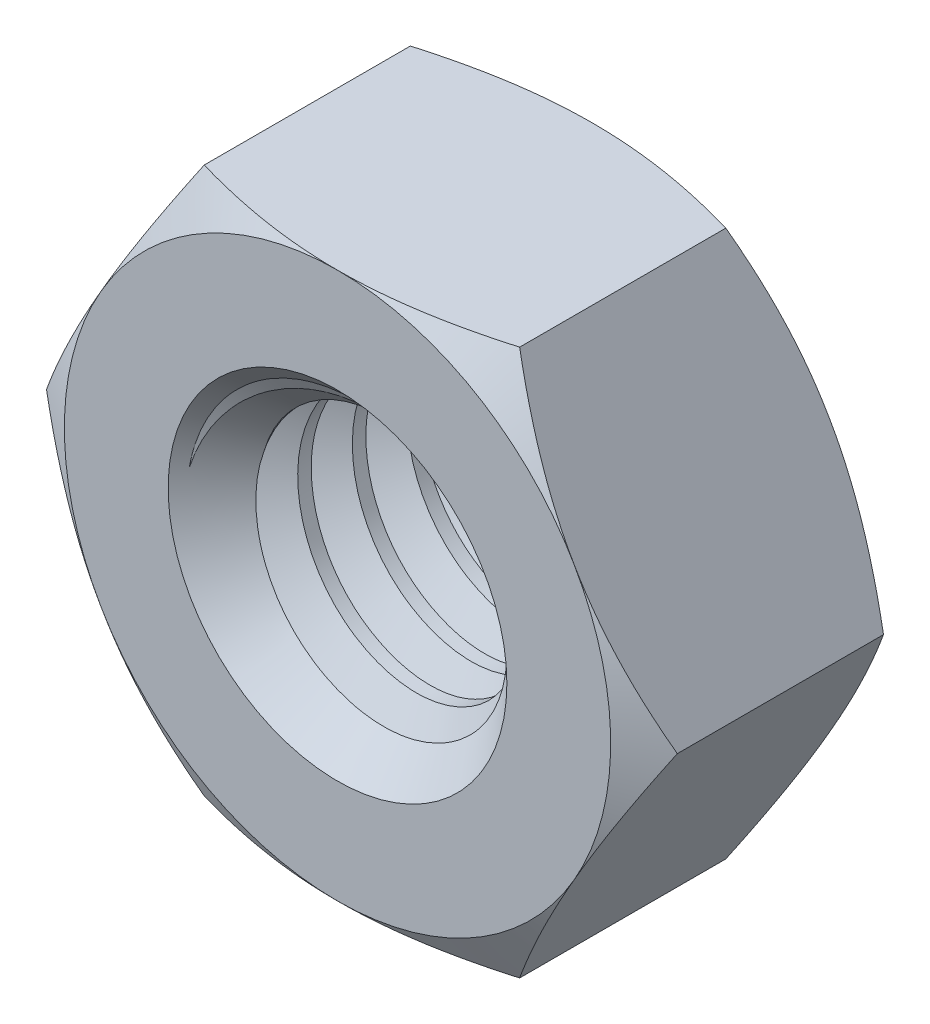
from build123d import *

# Parameters (mm, degrees)
Y_KSEKLIK_EKSTR_ZYON1_DEPTH = 2.8
IZIM2_OUTSIDE_W             = 20.544
IZIM2_OUTSIDE_H             = 19.616
IZIM2_OUTSIDE_R             = 3
KES_EKSTR_ZYON1_DEPTH       = 2.8
KES_EKSTR_ZYON1_DRAFT       = -60
IZIM3_OUTSIDE_W             = 20.544
IZIM3_OUTSIDE_H             = 19.616
IZIM3_OUTSIDE_R             = 3
KES_EKSTR_ZYON2_DEPTH       = 2.8
KES_EKSTR_ZYON2_DRAFT       = -60
IZIM4_R                     = 1.36
KES_EKSTR_ZYON3_DEPTH       = 2.8
PAH1_SIZE                   = 0.5
KES_S_P_R1_PITCH            = 0.6
KES_S_P_R1_HEIGHT           = 4
KES_S_P_R1_RADIUS           = 1.36


with BuildPart() as part:
    # izim1 → Y_kseklik-Ekstr_zyon1 (new body)
    with BuildSketch(Plane.XY):
        Polygon((3.464101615, 0), (1.732050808, 3), (-1.732050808, 3), (-3.464101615, 0), (-1.732050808, -3), (1.732050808, -3), align=None)
    extrude(amount=Y_KSEKLIK_EKSTR_ZYON1_DEPTH)


with BuildPart() as kes_ekstr_zyon1_tool:
    # izim2 outside → Kes-Ekstr_zyon1 (with draft: the straight prism first)
    with BuildSketch(Plane.XY.offset(2.8)):
        Rectangle(IZIM2_OUTSIDE_W, IZIM2_OUTSIDE_H)
        Circle(IZIM2_OUTSIDE_R, mode=Mode.SUBTRACT)
    extrude(amount=-KES_EKSTR_ZYON1_DEPTH)
    # Kes-Ekstr_zyon1: the draft: its side faces are tilted about the plane it starts from
    kes_ekstr_zyon1_sides = [kes_ekstr_zyon1_tool.faces().sort_by_distance(p)[0] for p in [
        (0, -9.808, 1.4),
        (10.272, 0, 1.4),
        (0, 9.808, 1.4),
        (-10.272, 0, 1.4),
        (-3, 0, 1.4),
    ]]
    draft(kes_ekstr_zyon1_sides, Plane.XY.offset(2.8), KES_EKSTR_ZYON1_DRAFT)


with BuildPart() as part_1:
    add(part.part)

    # Kes-Ekstr_zyon1: cut by kes_ekstr_zyon1_tool
    add(kes_ekstr_zyon1_tool.part, mode=Mode.SUBTRACT)


with BuildPart() as kes_ekstr_zyon2_tool:
    # izim3 outside → Kes-Ekstr_zyon2 (with draft: the straight prism first)
    with BuildSketch(Plane(origin=(0, 0, 0), x_dir=(-1, 0, 0), z_dir=(0, 0, -1))):
        Rectangle(IZIM3_OUTSIDE_W, IZIM3_OUTSIDE_H)
        Circle(IZIM3_OUTSIDE_R, mode=Mode.SUBTRACT)
    extrude(amount=-KES_EKSTR_ZYON2_DEPTH)
    # Kes-Ekstr_zyon2: the draft: its side faces are tilted about the plane it starts from
    kes_ekstr_zyon2_sides = [kes_ekstr_zyon2_tool.faces().sort_by_distance(p)[0] for p in [
        (0, -9.808, 1.4),
        (-10.272, 0, 1.4),
        (0, 9.808, 1.4),
        (10.272, 0, 1.4),
        (3, 0, 1.4),
    ]]
    draft(kes_ekstr_zyon2_sides, Plane(origin=(0, 0, 0), x_dir=(-1, 0, 0), z_dir=(0, 0, -1)), KES_EKSTR_ZYON2_DRAFT)


with BuildPart() as part_2:
    add(part_1.part)

    # Kes-Ekstr_zyon2: cut by kes_ekstr_zyon2_tool
    add(kes_ekstr_zyon2_tool.part, mode=Mode.SUBTRACT)

    # izim4 → Kes-Ekstr_zyon3 (cut)
    with BuildSketch(Plane(origin=(0, 0, 0), x_dir=(-1, 0, 0), z_dir=(0, 0, -1))):
        Circle(IZIM4_R)
    extrude(amount=-KES_EKSTR_ZYON3_DEPTH, mode=Mode.SUBTRACT)

    # Pah1
    pah1_edges = [part_2.edges().sort_by_distance(p)[0] for p in [
        (1.36, 0, 2.8),
        (1.36, 0, 0),
    ]]
    chamfer(pah1_edges, length=PAH1_SIZE)

    # Kes-S_p_r1: sweep along a helix
    with BuildLine() as kes_s_p_r1_path:
        Helix(KES_S_P_R1_PITCH, KES_S_P_R1_HEIGHT, KES_S_P_R1_RADIUS, center=(0, 0, 0), direction=(0, 0, 1))
    # izim6 → Kes-S_p_r1 (sweep, cut)
    with BuildSketch(Plane(origin=(-0.68, -1.177794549, 4), x_dir=(0.06065898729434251, -0.035021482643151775, -0.9975439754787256), z_dir=(0.8638984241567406, -0.4987719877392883, 0.07004296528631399))):
        Polygon((0.298300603, 0.126671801), (-0.298300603, 0.126671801), (0, -0.39), align=None)
    sweep(path=kes_s_p_r1_path.line, is_frenet=True, mode=Mode.SUBTRACT)


solid = part_2.part
